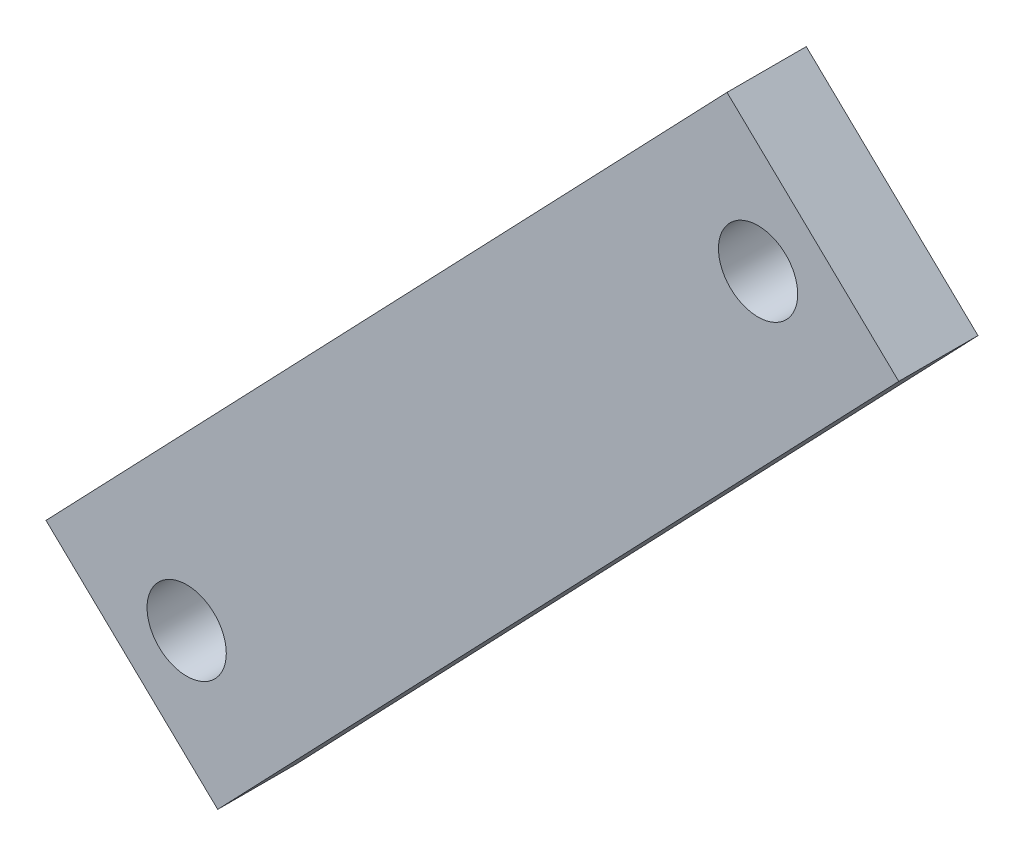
ISO-10303-21;
HEADER;
FILE_DESCRIPTION(('STEP AP214'),'2;1');
FILE_NAME('part.step','',(''),(''),'','','');
FILE_SCHEMA(('AUTOMOTIVE_DESIGN { 1 0 10303 214 1 1 1 1 }'));
ENDSEC;
DATA;
#1=APPLICATION_CONTEXT('core data for automotive mechanical design processes');
#2=APPLICATION_PROTOCOL_DEFINITION('international standard','automotive_design',2000,#1);
#3=PRODUCT_CONTEXT('',#1,'mechanical');
#4=PRODUCT('Part','Part','',(#3));
#5=PRODUCT_RELATED_PRODUCT_CATEGORY('part','',(#4));
#6=PRODUCT_DEFINITION_FORMATION('','',#4);
#7=PRODUCT_DEFINITION_CONTEXT('part definition',#1,'design');
#8=PRODUCT_DEFINITION('design','',#6,#7);
#9=PRODUCT_DEFINITION_SHAPE('','',#8);
#10=(LENGTH_UNIT() NAMED_UNIT(*) SI_UNIT(.MILLI.,.METRE.));
#11=(NAMED_UNIT(*) PLANE_ANGLE_UNIT() SI_UNIT($,.RADIAN.));
#12=(NAMED_UNIT(*) SI_UNIT($,.STERADIAN.) SOLID_ANGLE_UNIT());
#13=UNCERTAINTY_MEASURE_WITH_UNIT(LENGTH_MEASURE(1.E-05),#10,'distance_accuracy_value','');
#14=(GEOMETRIC_REPRESENTATION_CONTEXT(3) GLOBAL_UNCERTAINTY_ASSIGNED_CONTEXT((#13)) GLOBAL_UNIT_ASSIGNED_CONTEXT((#10,
#11,#12)) REPRESENTATION_CONTEXT('',''));
#15=CARTESIAN_POINT('',(0.,0.,0.));
#16=DIRECTION('',(0.,0.,1.));
#17=DIRECTION('',(1.,0.,0.));
#18=AXIS2_PLACEMENT_3D('',#15,#16,#17);
#19=CARTESIAN_POINT('',(-107.191207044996,603.561574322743,10.));
#20=DIRECTION('',(0.,0.,1.));
#21=DIRECTION('',(1.,0.,0.));
#22=AXIS2_PLACEMENT_3D('',#19,#20,#21);
#23=PLANE('',#22);
#24=CARTESIAN_POINT('',(-111.109112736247,621.158449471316,10.));
#25=DIRECTION('',(0.,0.,1.));
#26=DIRECTION('',(1.,0.,0.));
#27=AXIS2_PLACEMENT_3D('',#24,#25,#26);
#28=CIRCLE('',#27,4.99999999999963);
#29=CARTESIAN_POINT('',(-106.109112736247,621.158449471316,10.));
#30=VERTEX_POINT('',#29);
#31=EDGE_CURVE('E98',#30,#30,#28,.T.);
#32=ORIENTED_EDGE('',*,*,#31,.F.);
#33=EDGE_LOOP('',(#32));
#34=FACE_BOUND('',#33,.T.);
#35=DIRECTION('',(0.722268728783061,-0.691612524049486,0.));
#36=VECTOR('',#35,1.);
#37=CARTESIAN_POINT('',(-128.859268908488,624.309950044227,10.));
#38=LINE('',#37,#36);
#39=CARTESIAN_POINT('',(-128.859268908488,624.309950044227,10.));
#40=VERTEX_POINT('',#39);
#41=CARTESIAN_POINT('',(-107.191207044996,603.561574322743,10.));
#42=VERTEX_POINT('',#41);
#43=EDGE_CURVE('E83',#40,#42,#38,.T.);
#44=ORIENTED_EDGE('',*,*,#43,.T.);
#45=DIRECTION('',(0.691612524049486,0.722268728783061,0.));
#46=VECTOR('',#45,1.);
#47=CARTESIAN_POINT('',(-107.191207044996,603.561574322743,10.));
#48=LINE('',#47,#46);
#49=CARTESIAN_POINT('',(-21.2606273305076,693.301086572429,10.));
#50=VERTEX_POINT('',#49);
#51=EDGE_CURVE('E78',#42,#50,#48,.T.);
#52=ORIENTED_EDGE('',*,*,#51,.T.);
#53=DIRECTION('',(-0.722268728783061,0.691612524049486,0.));
#54=VECTOR('',#53,1.);
#55=CARTESIAN_POINT('',(-42.9286891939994,714.049462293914,10.));
#56=LINE('',#55,#54);
#57=CARTESIAN_POINT('',(-42.9286891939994,714.049462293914,10.));
#58=VERTEX_POINT('',#57);
#59=EDGE_CURVE('E81',#50,#58,#56,.T.);
#60=ORIENTED_EDGE('',*,*,#59,.T.);
#61=DIRECTION('',(-0.691612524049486,-0.722268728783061,0.));
#62=VECTOR('',#61,1.);
#63=CARTESIAN_POINT('',(-128.859268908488,624.309950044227,10.));
#64=LINE('',#63,#62);
#65=EDGE_CURVE('E48',#58,#40,#64,.T.);
#66=ORIENTED_EDGE('',*,*,#65,.T.);
#67=EDGE_LOOP('',(#44,#52,#60,#66));
#68=FACE_BOUND('',#67,.T.);
#69=CARTESIAN_POINT('',(-39.0107835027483,696.452587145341,10.));
#70=DIRECTION('',(0.,0.,1.));
#71=DIRECTION('',(1.,0.,0.));
#72=AXIS2_PLACEMENT_3D('',#69,#70,#71);
#73=CIRCLE('',#72,5.00000000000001);
#74=CARTESIAN_POINT('',(-34.0107835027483,696.452587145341,10.));
#75=VERTEX_POINT('',#74);
#76=EDGE_CURVE('E113',#75,#75,#73,.T.);
#77=ORIENTED_EDGE('',*,*,#76,.F.);
#78=EDGE_LOOP('',(#77));
#79=FACE_BOUND('',#78,.T.);
#80=ADVANCED_FACE('F31',(#34,#68,#79),#23,.T.);
#81=CARTESIAN_POINT('',(-107.191207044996,603.561574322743,0.));
#82=DIRECTION('',(0.,0.,1.));
#83=DIRECTION('',(1.,0.,0.));
#84=AXIS2_PLACEMENT_3D('',#81,#82,#83);
#85=PLANE('',#84);
#86=CARTESIAN_POINT('',(-111.109112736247,621.158449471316,0.));
#87=DIRECTION('',(0.,0.,1.));
#88=DIRECTION('',(1.,0.,0.));
#89=AXIS2_PLACEMENT_3D('',#86,#87,#88);
#90=CIRCLE('',#89,4.99999999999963);
#91=CARTESIAN_POINT('',(-106.109112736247,621.158449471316,0.));
#92=VERTEX_POINT('',#91);
#93=EDGE_CURVE('E110',#92,#92,#90,.T.);
#94=ORIENTED_EDGE('',*,*,#93,.T.);
#95=EDGE_LOOP('',(#94));
#96=FACE_BOUND('',#95,.T.);
#97=DIRECTION('',(0.722268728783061,-0.691612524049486,0.));
#98=VECTOR('',#97,1.);
#99=CARTESIAN_POINT('',(-128.859268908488,624.309950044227,0.));
#100=LINE('',#99,#98);
#101=CARTESIAN_POINT('',(-128.859268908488,624.309950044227,0.));
#102=VERTEX_POINT('',#101);
#103=CARTESIAN_POINT('',(-107.191207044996,603.561574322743,0.));
#104=VERTEX_POINT('',#103);
#105=EDGE_CURVE('E95',#102,#104,#100,.T.);
#106=ORIENTED_EDGE('',*,*,#105,.F.);
#107=DIRECTION('',(-0.691612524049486,-0.722268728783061,0.));
#108=VECTOR('',#107,1.);
#109=CARTESIAN_POINT('',(-128.859268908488,624.309950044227,0.));
#110=LINE('',#109,#108);
#111=CARTESIAN_POINT('',(-42.9286891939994,714.049462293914,0.));
#112=VERTEX_POINT('',#111);
#113=EDGE_CURVE('E71',#112,#102,#110,.T.);
#114=ORIENTED_EDGE('',*,*,#113,.F.);
#115=DIRECTION('',(-0.722268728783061,0.691612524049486,0.));
#116=VECTOR('',#115,1.);
#117=CARTESIAN_POINT('',(-42.9286891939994,714.049462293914,0.));
#118=LINE('',#117,#116);
#119=CARTESIAN_POINT('',(-21.2606273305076,693.301086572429,0.));
#120=VERTEX_POINT('',#119);
#121=EDGE_CURVE('E65',#120,#112,#118,.T.);
#122=ORIENTED_EDGE('',*,*,#121,.F.);
#123=DIRECTION('',(0.691612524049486,0.722268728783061,0.));
#124=VECTOR('',#123,1.);
#125=CARTESIAN_POINT('',(-107.191207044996,603.561574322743,0.));
#126=LINE('',#125,#124);
#127=EDGE_CURVE('E87',#104,#120,#126,.T.);
#128=ORIENTED_EDGE('',*,*,#127,.F.);
#129=EDGE_LOOP('',(#106,#114,#122,#128));
#130=FACE_BOUND('',#129,.T.);
#131=CARTESIAN_POINT('',(-39.0107835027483,696.452587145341,0.));
#132=DIRECTION('',(0.,0.,1.));
#133=DIRECTION('',(1.,0.,0.));
#134=AXIS2_PLACEMENT_3D('',#131,#132,#133);
#135=CIRCLE('',#134,5.00000000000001);
#136=CARTESIAN_POINT('',(-34.0107835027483,696.452587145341,0.));
#137=VERTEX_POINT('',#136);
#138=EDGE_CURVE('E116',#137,#137,#135,.T.);
#139=ORIENTED_EDGE('',*,*,#138,.T.);
#140=EDGE_LOOP('',(#139));
#141=FACE_BOUND('',#140,.T.);
#142=ADVANCED_FACE('F106',(#96,#130,#141),#85,.F.);
#143=CARTESIAN_POINT('',(-128.859268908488,624.309950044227,10.));
#144=DIRECTION('',(0.691612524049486,0.722268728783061,0.));
#145=DIRECTION('',(-0.722268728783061,0.691612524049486,0.));
#146=AXIS2_PLACEMENT_3D('',#143,#144,#145);
#147=PLANE('',#146);
#148=ORIENTED_EDGE('',*,*,#105,.T.);
#149=DIRECTION('',(0.,0.,-1.));
#150=VECTOR('',#149,1.);
#151=CARTESIAN_POINT('',(-107.191207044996,603.561574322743,10.));
#152=LINE('',#151,#150);
#153=EDGE_CURVE('E11',#42,#104,#152,.T.);
#154=ORIENTED_EDGE('',*,*,#153,.F.);
#155=ORIENTED_EDGE('',*,*,#43,.F.);
#156=DIRECTION('',(0.,0.,-1.));
#157=VECTOR('',#156,1.);
#158=CARTESIAN_POINT('',(-128.859268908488,624.309950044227,10.));
#159=LINE('',#158,#157);
#160=EDGE_CURVE('E91',#40,#102,#159,.T.);
#161=ORIENTED_EDGE('',*,*,#160,.T.);
#162=EDGE_LOOP('',(#148,#154,#155,#161));
#163=FACE_BOUND('',#162,.T.);
#164=ADVANCED_FACE('F33',(#163),#147,.F.);
#165=CARTESIAN_POINT('',(-107.191207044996,603.561574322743,10.));
#166=DIRECTION('',(-0.722268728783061,0.691612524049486,0.));
#167=DIRECTION('',(-0.691612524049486,-0.722268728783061,0.));
#168=AXIS2_PLACEMENT_3D('',#165,#166,#167);
#169=PLANE('',#168);
#170=ORIENTED_EDGE('',*,*,#127,.T.);
#171=DIRECTION('',(0.,0.,-1.));
#172=VECTOR('',#171,1.);
#173=CARTESIAN_POINT('',(-21.2606273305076,693.301086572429,10.));
#174=LINE('',#173,#172);
#175=EDGE_CURVE('E40',#50,#120,#174,.T.);
#176=ORIENTED_EDGE('',*,*,#175,.F.);
#177=ORIENTED_EDGE('',*,*,#51,.F.);
#178=ORIENTED_EDGE('',*,*,#153,.T.);
#179=EDGE_LOOP('',(#170,#176,#177,#178));
#180=FACE_BOUND('',#179,.T.);
#181=ADVANCED_FACE('F86',(#180),#169,.F.);
#182=CARTESIAN_POINT('',(-42.9286891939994,714.049462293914,10.));
#183=DIRECTION('',(-0.691612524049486,-0.722268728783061,0.));
#184=DIRECTION('',(0.722268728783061,-0.691612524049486,0.));
#185=AXIS2_PLACEMENT_3D('',#182,#183,#184);
#186=PLANE('',#185);
#187=ORIENTED_EDGE('',*,*,#121,.T.);
#188=DIRECTION('',(0.,0.,-1.));
#189=VECTOR('',#188,1.);
#190=CARTESIAN_POINT('',(-42.9286891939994,714.049462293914,10.));
#191=LINE('',#190,#189);
#192=EDGE_CURVE('E88',#58,#112,#191,.T.);
#193=ORIENTED_EDGE('',*,*,#192,.F.);
#194=ORIENTED_EDGE('',*,*,#59,.F.);
#195=ORIENTED_EDGE('',*,*,#175,.T.);
#196=EDGE_LOOP('',(#187,#193,#194,#195));
#197=FACE_BOUND('',#196,.T.);
#198=ADVANCED_FACE('F89',(#197),#186,.F.);
#199=CARTESIAN_POINT('',(-128.859268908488,624.309950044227,10.));
#200=DIRECTION('',(0.722268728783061,-0.691612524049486,0.));
#201=DIRECTION('',(0.691612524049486,0.722268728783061,0.));
#202=AXIS2_PLACEMENT_3D('',#199,#200,#201);
#203=PLANE('',#202);
#204=ORIENTED_EDGE('',*,*,#113,.T.);
#205=ORIENTED_EDGE('',*,*,#160,.F.);
#206=ORIENTED_EDGE('',*,*,#65,.F.);
#207=ORIENTED_EDGE('',*,*,#192,.T.);
#208=EDGE_LOOP('',(#204,#205,#206,#207));
#209=FACE_BOUND('',#208,.T.);
#210=ADVANCED_FACE('F103',(#209),#203,.F.);
#211=CARTESIAN_POINT('',(-111.109112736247,621.158449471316,10.));
#212=DIRECTION('',(0.,0.,-1.));
#213=DIRECTION('',(-1.,0.,0.));
#214=AXIS2_PLACEMENT_3D('',#211,#212,#213);
#215=CYLINDRICAL_SURFACE('',#214,4.99999999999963);
#216=ORIENTED_EDGE('',*,*,#31,.T.);
#217=EDGE_LOOP('',(#216));
#218=FACE_BOUND('',#217,.T.);
#219=ORIENTED_EDGE('',*,*,#93,.F.);
#220=EDGE_LOOP('',(#219));
#221=FACE_BOUND('',#220,.T.);
#222=ADVANCED_FACE('F134',(#218,#221),#215,.F.);
#223=CARTESIAN_POINT('',(-39.0107835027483,696.452587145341,10.));
#224=DIRECTION('',(0.,0.,-1.));
#225=DIRECTION('',(-1.,0.,0.));
#226=AXIS2_PLACEMENT_3D('',#223,#224,#225);
#227=CYLINDRICAL_SURFACE('',#226,5.00000000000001);
#228=ORIENTED_EDGE('',*,*,#76,.T.);
#229=EDGE_LOOP('',(#228));
#230=FACE_BOUND('',#229,.T.);
#231=ORIENTED_EDGE('',*,*,#138,.F.);
#232=EDGE_LOOP('',(#231));
#233=FACE_BOUND('',#232,.T.);
#234=ADVANCED_FACE('F122',(#230,#233),#227,.F.);
#235=CLOSED_SHELL('',(#80,#142,#164,#181,#198,#210,#222,#234));
#236=MANIFOLD_SOLID_BREP('B2',#235);
#237=ADVANCED_BREP_SHAPE_REPRESENTATION('',(#18,#236),#14);
#238=SHAPE_DEFINITION_REPRESENTATION(#9,#237);
ENDSEC;
END-ISO-10303-21;
